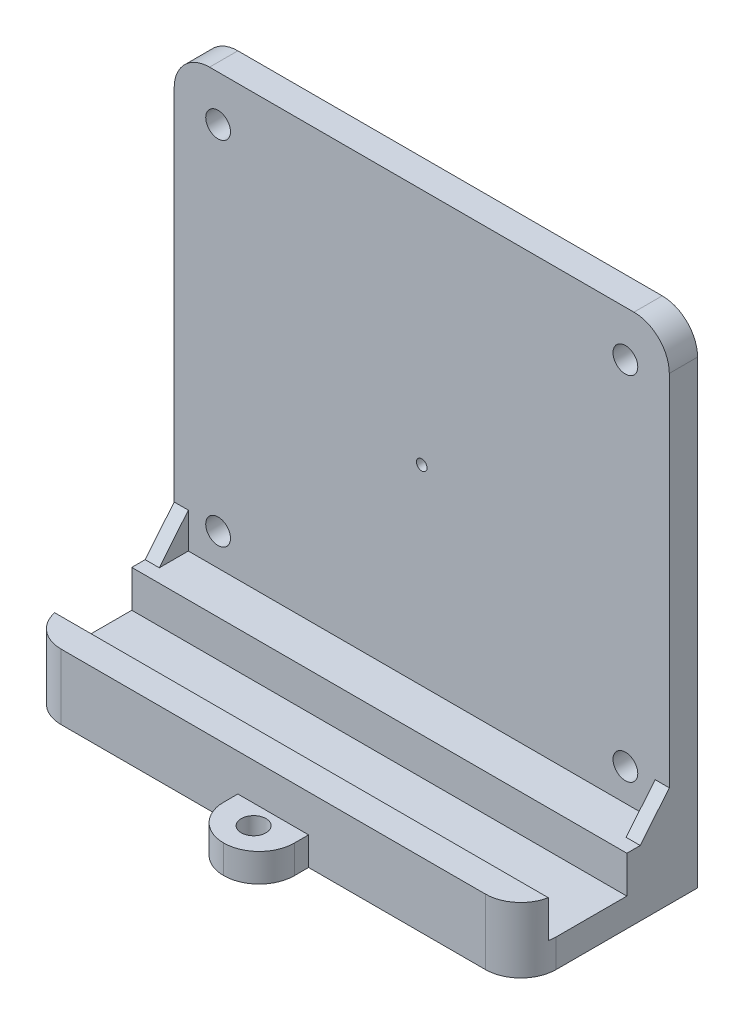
ISO-10303-21;
HEADER;
FILE_DESCRIPTION(('STEP AP214'),'2;1');
FILE_NAME('part.step','',(''),(''),'','','');
FILE_SCHEMA(('AUTOMOTIVE_DESIGN { 1 0 10303 214 1 1 1 1 }'));
ENDSEC;
DATA;
#1=APPLICATION_CONTEXT('core data for automotive mechanical design processes');
#2=APPLICATION_PROTOCOL_DEFINITION('international standard','automotive_design',2000,#1);
#3=PRODUCT_CONTEXT('',#1,'mechanical');
#4=PRODUCT('Part','Part','',(#3));
#5=PRODUCT_RELATED_PRODUCT_CATEGORY('part','',(#4));
#6=PRODUCT_DEFINITION_FORMATION('','',#4);
#7=PRODUCT_DEFINITION_CONTEXT('part definition',#1,'design');
#8=PRODUCT_DEFINITION('design','',#6,#7);
#9=PRODUCT_DEFINITION_SHAPE('','',#8);
#10=(LENGTH_UNIT() NAMED_UNIT(*) SI_UNIT(.MILLI.,.METRE.));
#11=(NAMED_UNIT(*) PLANE_ANGLE_UNIT() SI_UNIT($,.RADIAN.));
#12=(NAMED_UNIT(*) SI_UNIT($,.STERADIAN.) SOLID_ANGLE_UNIT());
#13=UNCERTAINTY_MEASURE_WITH_UNIT(LENGTH_MEASURE(1.E-05),#10,'distance_accuracy_value','');
#14=(GEOMETRIC_REPRESENTATION_CONTEXT(3) GLOBAL_UNCERTAINTY_ASSIGNED_CONTEXT((#13)) GLOBAL_UNIT_ASSIGNED_CONTEXT((#10,
#11,#12)) REPRESENTATION_CONTEXT('',''));
#15=CARTESIAN_POINT('',(0.,0.,0.));
#16=DIRECTION('',(0.,0.,1.));
#17=DIRECTION('',(1.,0.,0.));
#18=AXIS2_PLACEMENT_3D('',#15,#16,#17);
#19=CARTESIAN_POINT('',(-70.,3.93537414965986,-4.79591836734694));
#20=DIRECTION('',(0.,1.,0.));
#21=DIRECTION('',(0.,0.,1.));
#22=AXIS2_PLACEMENT_3D('',#19,#20,#21);
#23=PLANE('',#22);
#24=DIRECTION('',(0.,0.,-1.));
#25=VECTOR('',#24,1.);
#26=CARTESIAN_POINT('',(-68.,3.93537414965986,-6.68880737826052));
#27=LINE('',#26,#25);
#28=CARTESIAN_POINT('',(-68.,3.93537414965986,-6.68880737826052));
#29=VERTEX_POINT('',#28);
#30=CARTESIAN_POINT('',(-68.,3.93537414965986,-10.7959183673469));
#31=VERTEX_POINT('',#30);
#32=EDGE_CURVE('E280',#29,#31,#27,.T.);
#33=ORIENTED_EDGE('',*,*,#32,.F.);
#34=DIRECTION('',(-1.,0.,0.));
#35=VECTOR('',#34,1.);
#36=CARTESIAN_POINT('',(-68.,3.93537414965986,-6.68880737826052));
#37=LINE('',#36,#35);
#38=CARTESIAN_POINT('',(-70.,3.93537414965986,-6.68880737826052));
#39=VERTEX_POINT('',#38);
#40=EDGE_CURVE('E288',#29,#39,#37,.T.);
#41=ORIENTED_EDGE('',*,*,#40,.T.);
#42=DIRECTION('',(0.,0.,1.));
#43=VECTOR('',#42,1.);
#44=CARTESIAN_POINT('',(-70.,3.93537414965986,-4.79591836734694));
#45=LINE('',#44,#43);
#46=CARTESIAN_POINT('',(-70.,3.93537414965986,-4.79591836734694));
#47=VERTEX_POINT('',#46);
#48=EDGE_CURVE('E333',#39,#47,#45,.T.);
#49=ORIENTED_EDGE('',*,*,#48,.T.);
#50=DIRECTION('',(1.,0.,0.));
#51=VECTOR('',#50,1.);
#52=CARTESIAN_POINT('',(-70.,3.93537414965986,-4.79591836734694));
#53=LINE('',#52,#51);
#54=CARTESIAN_POINT('',(0.,3.93537414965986,-4.79591836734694));
#55=VERTEX_POINT('',#54);
#56=EDGE_CURVE('E379',#47,#55,#53,.T.);
#57=ORIENTED_EDGE('',*,*,#56,.T.);
#58=DIRECTION('',(0.,0.,1.));
#59=VECTOR('',#58,1.);
#60=CARTESIAN_POINT('',(0.,3.93537414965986,-4.79591836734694));
#61=LINE('',#60,#59);
#62=CARTESIAN_POINT('',(0.,3.93537414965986,-6.68880737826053));
#63=VERTEX_POINT('',#62);
#64=EDGE_CURVE('E355',#63,#55,#61,.T.);
#65=ORIENTED_EDGE('',*,*,#64,.F.);
#66=DIRECTION('',(1.,0.,0.));
#67=VECTOR('',#66,1.);
#68=CARTESIAN_POINT('',(-2.,3.93537414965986,-6.68880737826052));
#69=LINE('',#68,#67);
#70=CARTESIAN_POINT('',(-2.,3.93537414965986,-6.68880737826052));
#71=VERTEX_POINT('',#70);
#72=EDGE_CURVE('E314',#71,#63,#69,.T.);
#73=ORIENTED_EDGE('',*,*,#72,.F.);
#74=DIRECTION('',(0.,0.,-1.));
#75=VECTOR('',#74,1.);
#76=CARTESIAN_POINT('',(-2.,3.93537414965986,-6.68880737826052));
#77=LINE('',#76,#75);
#78=CARTESIAN_POINT('',(-2.,3.93537414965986,-10.7959183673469));
#79=VERTEX_POINT('',#78);
#80=EDGE_CURVE('E307',#71,#79,#77,.T.);
#81=ORIENTED_EDGE('',*,*,#80,.T.);
#82=DIRECTION('',(1.,0.,0.));
#83=VECTOR('',#82,1.);
#84=CARTESIAN_POINT('',(-70.,3.93537414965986,-10.7959183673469));
#85=LINE('',#84,#83);
#86=EDGE_CURVE('E383',#31,#79,#85,.T.);
#87=ORIENTED_EDGE('',*,*,#86,.F.);
#88=EDGE_LOOP('',(#33,#41,#49,#57,#65,#73,#81,#87));
#89=FACE_BOUND('',#88,.T.);
#90=ADVANCED_FACE('F39',(#89),#23,.T.);
#91=CARTESIAN_POINT('',(-70.,3.93537414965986,-10.7959183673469));
#92=DIRECTION('',(0.,0.,1.));
#93=DIRECTION('',(1.,0.,0.));
#94=AXIS2_PLACEMENT_3D('',#91,#92,#93);
#95=PLANE('',#94);
#96=CARTESIAN_POINT('',(-35.,30.9853741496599,-10.7959183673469));
#97=DIRECTION('',(0.,0.,1.));
#98=DIRECTION('',(1.,0.,0.));
#99=AXIS2_PLACEMENT_3D('',#96,#97,#98);
#100=CIRCLE('',#99,0.749999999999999);
#101=CARTESIAN_POINT('',(-34.25,30.9853741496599,-10.7959183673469));
#102=VERTEX_POINT('',#101);
#103=EDGE_CURVE('E487',#102,#102,#100,.T.);
#104=ORIENTED_EDGE('',*,*,#103,.F.);
#105=EDGE_LOOP('',(#104));
#106=FACE_BOUND('',#105,.T.);
#107=CARTESIAN_POINT('',(-63.7932426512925,58.2515739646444,-10.7959183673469));
#108=DIRECTION('',(0.,0.,-1.));
#109=DIRECTION('',(-1.,0.,0.));
#110=AXIS2_PLACEMENT_3D('',#107,#108,#109);
#111=CIRCLE('',#110,1.75);
#112=CARTESIAN_POINT('',(-65.5432426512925,58.2515739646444,-10.7959183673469));
#113=VERTEX_POINT('',#112);
#114=EDGE_CURVE('E249',#113,#113,#111,.T.);
#115=ORIENTED_EDGE('',*,*,#114,.T.);
#116=EDGE_LOOP('',(#115));
#117=FACE_BOUND('',#116,.T.);
#118=CARTESIAN_POINT('',(-63.7932426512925,8.46246083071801,-10.7959183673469));
#119=DIRECTION('',(0.,0.,-1.));
#120=DIRECTION('',(-1.,0.,0.));
#121=AXIS2_PLACEMENT_3D('',#118,#119,#120);
#122=CIRCLE('',#121,1.75);
#123=CARTESIAN_POINT('',(-65.5432426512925,8.46246083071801,-10.7959183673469));
#124=VERTEX_POINT('',#123);
#125=EDGE_CURVE('E243',#124,#124,#122,.T.);
#126=ORIENTED_EDGE('',*,*,#125,.T.);
#127=EDGE_LOOP('',(#126));
#128=FACE_BOUND('',#127,.T.);
#129=CARTESIAN_POINT('',(-6.20675734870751,58.2515739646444,-10.7959183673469));
#130=DIRECTION('',(0.,0.,1.));
#131=DIRECTION('',(1.,0.,0.));
#132=AXIS2_PLACEMENT_3D('',#129,#130,#131);
#133=CIRCLE('',#132,1.75);
#134=CARTESIAN_POINT('',(-4.45675734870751,58.2515739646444,-10.7959183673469));
#135=VERTEX_POINT('',#134);
#136=EDGE_CURVE('E265',#135,#135,#133,.T.);
#137=ORIENTED_EDGE('',*,*,#136,.F.);
#138=EDGE_LOOP('',(#137));
#139=FACE_BOUND('',#138,.T.);
#140=CARTESIAN_POINT('',(-6.20675734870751,8.46246083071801,-10.7959183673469));
#141=DIRECTION('',(0.,0.,1.));
#142=DIRECTION('',(1.,0.,0.));
#143=AXIS2_PLACEMENT_3D('',#140,#141,#142);
#144=CIRCLE('',#143,1.75);
#145=CARTESIAN_POINT('',(-4.45675734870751,8.46246083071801,-10.7959183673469));
#146=VERTEX_POINT('',#145);
#147=EDGE_CURVE('E248',#146,#146,#144,.T.);
#148=ORIENTED_EDGE('',*,*,#147,.F.);
#149=EDGE_LOOP('',(#148));
#150=FACE_BOUND('',#149,.T.);
#151=DIRECTION('',(0.,-1.,0.));
#152=VECTOR('',#151,1.);
#153=CARTESIAN_POINT('',(-70.,3.93537414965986,-10.7959183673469));
#154=LINE('',#153,#152);
#155=CARTESIAN_POINT('',(-70.,59.6853741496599,-10.7959183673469));
#156=VERTEX_POINT('',#155);
#157=CARTESIAN_POINT('',(-70.,8.94117604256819,-10.7959183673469));
#158=VERTEX_POINT('',#157);
#159=EDGE_CURVE('E330',#156,#158,#154,.T.);
#160=ORIENTED_EDGE('',*,*,#159,.T.);
#161=DIRECTION('',(-1.,0.,0.));
#162=VECTOR('',#161,1.);
#163=CARTESIAN_POINT('',(-68.,8.94117604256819,-10.7959183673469));
#164=LINE('',#163,#162);
#165=CARTESIAN_POINT('',(-68.,8.94117604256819,-10.7959183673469));
#166=VERTEX_POINT('',#165);
#167=EDGE_CURVE('E292',#166,#158,#164,.T.);
#168=ORIENTED_EDGE('',*,*,#167,.F.);
#169=DIRECTION('',(0.,1.,0.));
#170=VECTOR('',#169,1.);
#171=CARTESIAN_POINT('',(-68.,3.93537414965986,-10.7959183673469));
#172=LINE('',#171,#170);
#173=EDGE_CURVE('E276',#31,#166,#172,.T.);
#174=ORIENTED_EDGE('',*,*,#173,.F.);
#175=ORIENTED_EDGE('',*,*,#86,.T.);
#176=DIRECTION('',(0.,1.,0.));
#177=VECTOR('',#176,1.);
#178=CARTESIAN_POINT('',(-2.,3.93537414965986,-10.7959183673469));
#179=LINE('',#178,#177);
#180=CARTESIAN_POINT('',(-2.,8.94117604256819,-10.7959183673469));
#181=VERTEX_POINT('',#180);
#182=EDGE_CURVE('E300',#79,#181,#179,.T.);
#183=ORIENTED_EDGE('',*,*,#182,.T.);
#184=DIRECTION('',(1.,0.,0.));
#185=VECTOR('',#184,1.);
#186=CARTESIAN_POINT('',(-2.,8.94117604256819,-10.7959183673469));
#187=LINE('',#186,#185);
#188=CARTESIAN_POINT('',(0.,8.94117604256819,-10.7959183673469));
#189=VERTEX_POINT('',#188);
#190=EDGE_CURVE('E311',#181,#189,#187,.T.);
#191=ORIENTED_EDGE('',*,*,#190,.T.);
#192=DIRECTION('',(0.,-1.,0.));
#193=VECTOR('',#192,1.);
#194=CARTESIAN_POINT('',(0.,3.93537414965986,-10.7959183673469));
#195=LINE('',#194,#193);
#196=CARTESIAN_POINT('',(0.,59.6853741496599,-10.7959183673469));
#197=VERTEX_POINT('',#196);
#198=EDGE_CURVE('E351',#197,#189,#195,.T.);
#199=ORIENTED_EDGE('',*,*,#198,.F.);
#200=CARTESIAN_POINT('',(-5.,59.6853741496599,-10.7959183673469));
#201=DIRECTION('',(0.,0.,1.));
#202=DIRECTION('',(1.,0.,0.));
#203=AXIS2_PLACEMENT_3D('',#200,#201,#202);
#204=CIRCLE('',#203,5.);
#205=CARTESIAN_POINT('',(-5.,64.6853741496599,-10.7959183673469));
#206=VERTEX_POINT('',#205);
#207=EDGE_CURVE('E407',#197,#206,#204,.T.);
#208=ORIENTED_EDGE('',*,*,#207,.T.);
#209=DIRECTION('',(1.,0.,0.));
#210=VECTOR('',#209,1.);
#211=CARTESIAN_POINT('',(-70.,64.6853741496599,-10.7959183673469));
#212=LINE('',#211,#210);
#213=CARTESIAN_POINT('',(-65.,64.6853741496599,-10.7959183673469));
#214=VERTEX_POINT('',#213);
#215=EDGE_CURVE('E386',#214,#206,#212,.T.);
#216=ORIENTED_EDGE('',*,*,#215,.F.);
#217=CARTESIAN_POINT('',(-65.,59.6853741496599,-10.7959183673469));
#218=DIRECTION('',(0.,0.,1.));
#219=DIRECTION('',(1.,0.,0.));
#220=AXIS2_PLACEMENT_3D('',#217,#218,#219);
#221=CIRCLE('',#220,5.);
#222=EDGE_CURVE('E404',#214,#156,#221,.T.);
#223=ORIENTED_EDGE('',*,*,#222,.T.);
#224=EDGE_LOOP('',(#160,#168,#174,#175,#183,#191,#199,#208,#216,#223));
#225=FACE_BOUND('',#224,.T.);
#226=ADVANCED_FACE('F526',(#106,#117,#128,#139,#150,#225),#95,.T.);
#227=CARTESIAN_POINT('',(-70.,-5.31462585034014,10.2040816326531));
#228=DIRECTION('',(0.,0.,1.));
#229=DIRECTION('',(1.,0.,0.));
#230=AXIS2_PLACEMENT_3D('',#227,#228,#229);
#231=PLANE('',#230);
#232=DIRECTION('',(1.,0.,0.));
#233=VECTOR('',#232,1.);
#234=CARTESIAN_POINT('',(-70.,3.93537414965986,10.2040816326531));
#235=LINE('',#234,#233);
#236=CARTESIAN_POINT('',(-65.,3.93537414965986,10.2040816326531));
#237=VERTEX_POINT('',#236);
#238=CARTESIAN_POINT('',(-5.,3.93537414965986,10.2040816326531));
#239=VERTEX_POINT('',#238);
#240=EDGE_CURVE('E365',#237,#239,#235,.T.);
#241=ORIENTED_EDGE('',*,*,#240,.F.);
#242=DIRECTION('',(0.,-1.,0.));
#243=VECTOR('',#242,1.);
#244=CARTESIAN_POINT('',(-65.,-5.31462585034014,10.2040816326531));
#245=LINE('',#244,#243);
#246=CARTESIAN_POINT('',(-65.,-5.31462585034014,10.2040816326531));
#247=VERTEX_POINT('',#246);
#248=EDGE_CURVE('E452',#237,#247,#245,.T.);
#249=ORIENTED_EDGE('',*,*,#248,.T.);
#250=DIRECTION('',(1.,0.,0.));
#251=VECTOR('',#250,1.);
#252=CARTESIAN_POINT('',(-70.,-5.31462585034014,10.2040816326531));
#253=LINE('',#252,#251);
#254=CARTESIAN_POINT('',(-40.,-5.31462585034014,10.2040816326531));
#255=VERTEX_POINT('',#254);
#256=EDGE_CURVE('E398',#247,#255,#253,.T.);
#257=ORIENTED_EDGE('',*,*,#256,.T.);
#258=DIRECTION('',(0.,-1.,0.));
#259=VECTOR('',#258,1.);
#260=CARTESIAN_POINT('',(-40.,-5.31462585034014,10.2040816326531));
#261=LINE('',#260,#259);
#262=CARTESIAN_POINT('',(-40.,-1.31462585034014,10.2040816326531));
#263=VERTEX_POINT('',#262);
#264=EDGE_CURVE('E223',#263,#255,#261,.T.);
#265=ORIENTED_EDGE('',*,*,#264,.F.);
#266=DIRECTION('',(-1.,0.,0.));
#267=VECTOR('',#266,1.);
#268=CARTESIAN_POINT('',(-40.,-1.31462585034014,10.2040816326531));
#269=LINE('',#268,#267);
#270=CARTESIAN_POINT('',(-30.,-1.31462585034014,10.2040816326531));
#271=VERTEX_POINT('',#270);
#272=EDGE_CURVE('E203',#271,#263,#269,.T.);
#273=ORIENTED_EDGE('',*,*,#272,.F.);
#274=DIRECTION('',(0.,1.,0.));
#275=VECTOR('',#274,1.);
#276=CARTESIAN_POINT('',(-30.,-5.31462585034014,10.2040816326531));
#277=LINE('',#276,#275);
#278=CARTESIAN_POINT('',(-30.,-5.31462585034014,10.2040816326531));
#279=VERTEX_POINT('',#278);
#280=EDGE_CURVE('E220',#279,#271,#277,.T.);
#281=ORIENTED_EDGE('',*,*,#280,.F.);
#282=CARTESIAN_POINT('',(-5.,-5.31462585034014,10.2040816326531));
#283=VERTEX_POINT('',#282);
#284=EDGE_CURVE('E344',#279,#283,#253,.T.);
#285=ORIENTED_EDGE('',*,*,#284,.T.);
#286=DIRECTION('',(0.,-1.,0.));
#287=VECTOR('',#286,1.);
#288=CARTESIAN_POINT('',(-5.,3.93537414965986,10.2040816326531));
#289=LINE('',#288,#287);
#290=EDGE_CURVE('E449',#283,#239,#289,.F.);
#291=ORIENTED_EDGE('',*,*,#290,.T.);
#292=EDGE_LOOP('',(#241,#249,#257,#265,#273,#281,#285,#291));
#293=FACE_BOUND('',#292,.T.);
#294=ADVANCED_FACE('F218',(#293),#231,.T.);
#295=CARTESIAN_POINT('',(-70.,3.93537414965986,10.2040816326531));
#296=DIRECTION('',(0.,1.,0.));
#297=DIRECTION('',(0.,0.,1.));
#298=AXIS2_PLACEMENT_3D('',#295,#296,#297);
#299=PLANE('',#298);
#300=DIRECTION('',(1.,0.,0.));
#301=VECTOR('',#300,1.);
#302=CARTESIAN_POINT('',(-70.,3.93537414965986,6.20408163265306));
#303=LINE('',#302,#301);
#304=CARTESIAN_POINT('',(-69.8989794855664,3.93537414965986,6.20408163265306));
#305=VERTEX_POINT('',#304);
#306=CARTESIAN_POINT('',(-0.101020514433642,3.93537414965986,6.20408163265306));
#307=VERTEX_POINT('',#306);
#308=EDGE_CURVE('E369',#305,#307,#303,.T.);
#309=ORIENTED_EDGE('',*,*,#308,.F.);
#310=CARTESIAN_POINT('',(-65.,3.93537414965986,5.20408163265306));
#311=DIRECTION('',(0.,1.,0.));
#312=DIRECTION('',(0.,0.,1.));
#313=AXIS2_PLACEMENT_3D('',#310,#311,#312);
#314=CIRCLE('',#313,5.);
#315=EDGE_CURVE('E49',#305,#237,#314,.T.);
#316=ORIENTED_EDGE('',*,*,#315,.T.);
#317=ORIENTED_EDGE('',*,*,#240,.T.);
#318=CARTESIAN_POINT('',(-5.,3.93537414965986,5.20408163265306));
#319=DIRECTION('',(0.,1.,0.));
#320=DIRECTION('',(0.,0.,1.));
#321=AXIS2_PLACEMENT_3D('',#318,#319,#320);
#322=CIRCLE('',#321,5.);
#323=EDGE_CURVE('E57',#239,#307,#322,.T.);
#324=ORIENTED_EDGE('',*,*,#323,.T.);
#325=EDGE_LOOP('',(#309,#316,#317,#324));
#326=FACE_BOUND('',#325,.T.);
#327=ADVANCED_FACE('F600',(#326),#299,.T.);
#328=CARTESIAN_POINT('',(-70.,3.93537414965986,6.20408163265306));
#329=DIRECTION('',(0.,0.,-1.));
#330=DIRECTION('',(0.,1.,0.));
#331=AXIS2_PLACEMENT_3D('',#328,#329,#330);
#332=PLANE('',#331);
#333=DIRECTION('',(1.,0.,0.));
#334=VECTOR('',#333,1.);
#335=CARTESIAN_POINT('',(-70.,-1.31462585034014,6.20408163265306));
#336=LINE('',#335,#334);
#337=CARTESIAN_POINT('',(-69.8989794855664,-1.31462585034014,6.20408163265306));
#338=VERTEX_POINT('',#337);
#339=CARTESIAN_POINT('',(-0.101020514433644,-1.31462585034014,6.20408163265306));
#340=VERTEX_POINT('',#339);
#341=EDGE_CURVE('E372',#338,#340,#336,.T.);
#342=ORIENTED_EDGE('',*,*,#341,.F.);
#343=DIRECTION('',(0.,-1.,0.));
#344=VECTOR('',#343,1.);
#345=CARTESIAN_POINT('',(-69.8989794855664,-1.31462585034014,6.20408163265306));
#346=LINE('',#345,#344);
#347=EDGE_CURVE('E64',#338,#305,#346,.F.);
#348=ORIENTED_EDGE('',*,*,#347,.T.);
#349=ORIENTED_EDGE('',*,*,#308,.T.);
#350=DIRECTION('',(0.,1.,0.));
#351=VECTOR('',#350,1.);
#352=CARTESIAN_POINT('',(-0.101020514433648,3.93537414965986,6.20408163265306));
#353=LINE('',#352,#351);
#354=EDGE_CURVE('E465',#307,#340,#353,.F.);
#355=ORIENTED_EDGE('',*,*,#354,.T.);
#356=EDGE_LOOP('',(#342,#348,#349,#355));
#357=FACE_BOUND('',#356,.T.);
#358=ADVANCED_FACE('F620',(#357),#332,.T.);
#359=CARTESIAN_POINT('',(-70.,-1.31462585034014,6.20408163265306));
#360=DIRECTION('',(0.,1.,0.));
#361=DIRECTION('',(0.,0.,1.));
#362=AXIS2_PLACEMENT_3D('',#359,#360,#361);
#363=PLANE('',#362);
#364=DIRECTION('',(0.,0.,1.));
#365=VECTOR('',#364,1.);
#366=CARTESIAN_POINT('',(-70.,-1.31462585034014,6.20408163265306));
#367=LINE('',#366,#365);
#368=CARTESIAN_POINT('',(-70.,-1.31462585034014,-4.79591836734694));
#369=VERTEX_POINT('',#368);
#370=CARTESIAN_POINT('',(-70.,-1.31462585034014,5.20408163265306));
#371=VERTEX_POINT('',#370);
#372=EDGE_CURVE('E340',#369,#371,#367,.T.);
#373=ORIENTED_EDGE('',*,*,#372,.T.);
#374=CARTESIAN_POINT('',(-65.,-1.31462585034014,5.20408163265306));
#375=DIRECTION('',(0.,1.,0.));
#376=DIRECTION('',(0.,0.,1.));
#377=AXIS2_PLACEMENT_3D('',#374,#375,#376);
#378=CIRCLE('',#377,5.);
#379=EDGE_CURVE('E462',#371,#338,#378,.T.);
#380=ORIENTED_EDGE('',*,*,#379,.T.);
#381=ORIENTED_EDGE('',*,*,#341,.T.);
#382=CARTESIAN_POINT('',(-5.,-1.31462585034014,5.20408163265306));
#383=DIRECTION('',(0.,1.,0.));
#384=DIRECTION('',(0.,0.,1.));
#385=AXIS2_PLACEMENT_3D('',#382,#383,#384);
#386=CIRCLE('',#385,5.);
#387=CARTESIAN_POINT('',(0.,-1.31462585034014,5.20408163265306));
#388=VERTEX_POINT('',#387);
#389=EDGE_CURVE('E459',#340,#388,#386,.T.);
#390=ORIENTED_EDGE('',*,*,#389,.T.);
#391=DIRECTION('',(0.,0.,1.));
#392=VECTOR('',#391,1.);
#393=CARTESIAN_POINT('',(0.,-1.31462585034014,6.20408163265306));
#394=LINE('',#393,#392);
#395=CARTESIAN_POINT('',(0.,-1.31462585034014,-4.79591836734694));
#396=VERTEX_POINT('',#395);
#397=EDGE_CURVE('E326',#396,#388,#394,.T.);
#398=ORIENTED_EDGE('',*,*,#397,.F.);
#399=DIRECTION('',(1.,0.,0.));
#400=VECTOR('',#399,1.);
#401=CARTESIAN_POINT('',(-70.,-1.31462585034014,-4.79591836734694));
#402=LINE('',#401,#400);
#403=EDGE_CURVE('E376',#369,#396,#402,.T.);
#404=ORIENTED_EDGE('',*,*,#403,.F.);
#405=EDGE_LOOP('',(#373,#380,#381,#390,#398,#404));
#406=FACE_BOUND('',#405,.T.);
#407=ADVANCED_FACE('F548',(#406),#363,.T.);
#408=CARTESIAN_POINT('',(-70.,-1.31462585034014,-4.79591836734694));
#409=DIRECTION('',(0.,0.,1.));
#410=DIRECTION('',(1.,0.,0.));
#411=AXIS2_PLACEMENT_3D('',#408,#409,#410);
#412=PLANE('',#411);
#413=DIRECTION('',(0.,-1.,0.));
#414=VECTOR('',#413,1.);
#415=CARTESIAN_POINT('',(0.,-1.31462585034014,-4.79591836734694));
#416=LINE('',#415,#414);
#417=EDGE_CURVE('E358',#55,#396,#416,.T.);
#418=ORIENTED_EDGE('',*,*,#417,.F.);
#419=ORIENTED_EDGE('',*,*,#56,.F.);
#420=DIRECTION('',(0.,-1.,0.));
#421=VECTOR('',#420,1.);
#422=CARTESIAN_POINT('',(-70.,-1.31462585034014,-4.79591836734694));
#423=LINE('',#422,#421);
#424=EDGE_CURVE('E336',#47,#369,#423,.T.);
#425=ORIENTED_EDGE('',*,*,#424,.T.);
#426=ORIENTED_EDGE('',*,*,#403,.T.);
#427=EDGE_LOOP('',(#418,#419,#425,#426));
#428=FACE_BOUND('',#427,.T.);
#429=ADVANCED_FACE('F544',(#428),#412,.T.);
#430=CARTESIAN_POINT('',(-70.,64.6853741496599,-10.7959183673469));
#431=DIRECTION('',(0.,1.,0.));
#432=DIRECTION('',(0.,0.,1.));
#433=AXIS2_PLACEMENT_3D('',#430,#431,#432);
#434=PLANE('',#433);
#435=ORIENTED_EDGE('',*,*,#215,.T.);
#436=DIRECTION('',(0.,0.,1.));
#437=VECTOR('',#436,1.);
#438=CARTESIAN_POINT('',(-5.,64.6853741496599,-14.7959183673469));
#439=LINE('',#438,#437);
#440=CARTESIAN_POINT('',(-5.,64.6853741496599,-14.7959183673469));
#441=VERTEX_POINT('',#440);
#442=EDGE_CURVE('E414',#206,#441,#439,.F.);
#443=ORIENTED_EDGE('',*,*,#442,.T.);
#444=DIRECTION('',(1.,0.,0.));
#445=VECTOR('',#444,1.);
#446=CARTESIAN_POINT('',(-70.,64.6853741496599,-14.7959183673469));
#447=LINE('',#446,#445);
#448=CARTESIAN_POINT('',(-65.,64.6853741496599,-14.7959183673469));
#449=VERTEX_POINT('',#448);
#450=EDGE_CURVE('E390',#449,#441,#447,.T.);
#451=ORIENTED_EDGE('',*,*,#450,.F.);
#452=DIRECTION('',(0.,0.,1.));
#453=VECTOR('',#452,1.);
#454=CARTESIAN_POINT('',(-65.,64.6853741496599,-10.7959183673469));
#455=LINE('',#454,#453);
#456=EDGE_CURVE('E410',#449,#214,#455,.T.);
#457=ORIENTED_EDGE('',*,*,#456,.T.);
#458=EDGE_LOOP('',(#435,#443,#451,#457));
#459=FACE_BOUND('',#458,.T.);
#460=ADVANCED_FACE('F502',(#459),#434,.T.);
#461=CARTESIAN_POINT('',(-70.,64.6853741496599,-14.7959183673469));
#462=DIRECTION('',(0.,0.,-1.));
#463=DIRECTION('',(0.,1.,0.));
#464=AXIS2_PLACEMENT_3D('',#461,#462,#463);
#465=PLANE('',#464);
#466=CARTESIAN_POINT('',(-35.,30.9853741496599,-14.7959183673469));
#467=DIRECTION('',(0.,0.,-1.));
#468=DIRECTION('',(0.,1.,0.));
#469=AXIS2_PLACEMENT_3D('',#466,#467,#468);
#470=CIRCLE('',#469,0.749999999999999);
#471=CARTESIAN_POINT('',(-35.,31.7353741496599,-14.7959183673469));
#472=VERTEX_POINT('',#471);
#473=EDGE_CURVE('E43',#472,#472,#470,.T.);
#474=ORIENTED_EDGE('',*,*,#473,.F.);
#475=EDGE_LOOP('',(#474));
#476=FACE_BOUND('',#475,.T.);
#477=CARTESIAN_POINT('',(-63.7932426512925,58.2515739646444,-14.7959183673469));
#478=DIRECTION('',(0.,0.,-1.));
#479=DIRECTION('',(-1.,0.,0.));
#480=AXIS2_PLACEMENT_3D('',#477,#478,#479);
#481=CIRCLE('',#480,1.75);
#482=CARTESIAN_POINT('',(-65.5432426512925,58.2515739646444,-14.7959183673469));
#483=VERTEX_POINT('',#482);
#484=EDGE_CURVE('E244',#483,#483,#481,.T.);
#485=ORIENTED_EDGE('',*,*,#484,.F.);
#486=EDGE_LOOP('',(#485));
#487=FACE_BOUND('',#486,.T.);
#488=CARTESIAN_POINT('',(-63.7932426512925,8.46246083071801,-14.7959183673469));
#489=DIRECTION('',(0.,0.,-1.));
#490=DIRECTION('',(-1.,0.,0.));
#491=AXIS2_PLACEMENT_3D('',#488,#489,#490);
#492=CIRCLE('',#491,1.75);
#493=CARTESIAN_POINT('',(-65.5432426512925,8.46246083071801,-14.7959183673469));
#494=VERTEX_POINT('',#493);
#495=EDGE_CURVE('E253',#494,#494,#492,.T.);
#496=ORIENTED_EDGE('',*,*,#495,.F.);
#497=EDGE_LOOP('',(#496));
#498=FACE_BOUND('',#497,.T.);
#499=CARTESIAN_POINT('',(-6.20675734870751,58.2515739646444,-14.7959183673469));
#500=DIRECTION('',(0.,0.,1.));
#501=DIRECTION('',(1.,0.,0.));
#502=AXIS2_PLACEMENT_3D('',#499,#500,#501);
#503=CIRCLE('',#502,1.75);
#504=CARTESIAN_POINT('',(-4.45675734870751,58.2515739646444,-14.7959183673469));
#505=VERTEX_POINT('',#504);
#506=EDGE_CURVE('E260',#505,#505,#503,.T.);
#507=ORIENTED_EDGE('',*,*,#506,.T.);
#508=EDGE_LOOP('',(#507));
#509=FACE_BOUND('',#508,.T.);
#510=CARTESIAN_POINT('',(-6.20675734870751,8.46246083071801,-14.7959183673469));
#511=DIRECTION('',(0.,0.,1.));
#512=DIRECTION('',(1.,0.,0.));
#513=AXIS2_PLACEMENT_3D('',#510,#511,#512);
#514=CIRCLE('',#513,1.75);
#515=CARTESIAN_POINT('',(-4.45675734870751,8.46246083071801,-14.7959183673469));
#516=VERTEX_POINT('',#515);
#517=EDGE_CURVE('E269',#516,#516,#514,.T.);
#518=ORIENTED_EDGE('',*,*,#517,.T.);
#519=EDGE_LOOP('',(#518));
#520=FACE_BOUND('',#519,.T.);
#521=ORIENTED_EDGE('',*,*,#450,.T.);
#522=CARTESIAN_POINT('',(-5.,59.6853741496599,-14.7959183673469));
#523=DIRECTION('',(0.,0.,-1.));
#524=DIRECTION('',(0.,1.,0.));
#525=AXIS2_PLACEMENT_3D('',#522,#523,#524);
#526=CIRCLE('',#525,5.);
#527=CARTESIAN_POINT('',(0.,59.6853741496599,-14.7959183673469));
#528=VERTEX_POINT('',#527);
#529=EDGE_CURVE('E420',#441,#528,#526,.T.);
#530=ORIENTED_EDGE('',*,*,#529,.T.);
#531=DIRECTION('',(0.,1.,0.));
#532=VECTOR('',#531,1.);
#533=CARTESIAN_POINT('',(0.,64.6853741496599,-14.7959183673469));
#534=LINE('',#533,#532);
#535=CARTESIAN_POINT('',(0.,-5.31462585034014,-14.7959183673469));
#536=VERTEX_POINT('',#535);
#537=EDGE_CURVE('E347',#536,#528,#534,.T.);
#538=ORIENTED_EDGE('',*,*,#537,.F.);
#539=DIRECTION('',(1.,0.,0.));
#540=VECTOR('',#539,1.);
#541=CARTESIAN_POINT('',(-70.,-5.31462585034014,-14.7959183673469));
#542=LINE('',#541,#540);
#543=CARTESIAN_POINT('',(-70.,-5.31462585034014,-14.7959183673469));
#544=VERTEX_POINT('',#543);
#545=EDGE_CURVE('E394',#544,#536,#542,.T.);
#546=ORIENTED_EDGE('',*,*,#545,.F.);
#547=DIRECTION('',(0.,1.,0.));
#548=VECTOR('',#547,1.);
#549=CARTESIAN_POINT('',(-70.,64.6853741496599,-14.7959183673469));
#550=LINE('',#549,#548);
#551=CARTESIAN_POINT('',(-70.,59.6853741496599,-14.7959183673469));
#552=VERTEX_POINT('',#551);
#553=EDGE_CURVE('E325',#544,#552,#550,.T.);
#554=ORIENTED_EDGE('',*,*,#553,.T.);
#555=CARTESIAN_POINT('',(-65.,59.6853741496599,-14.7959183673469));
#556=DIRECTION('',(0.,0.,-1.));
#557=DIRECTION('',(0.,1.,0.));
#558=AXIS2_PLACEMENT_3D('',#555,#556,#557);
#559=CIRCLE('',#558,5.);
#560=EDGE_CURVE('E417',#552,#449,#559,.T.);
#561=ORIENTED_EDGE('',*,*,#560,.T.);
#562=EDGE_LOOP('',(#521,#530,#538,#546,#554,#561));
#563=FACE_BOUND('',#562,.T.);
#564=ADVANCED_FACE('F498',(#476,#487,#498,#509,#520,#563),#465,.T.);
#565=CARTESIAN_POINT('',(-70.,-5.31462585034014,10.2040816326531));
#566=DIRECTION('',(0.,-1.,0.));
#567=DIRECTION('',(0.,0.,-1.));
#568=AXIS2_PLACEMENT_3D('',#565,#566,#567);
#569=PLANE('',#568);
#570=CARTESIAN_POINT('',(-35.0035421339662,-5.31462585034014,12.971264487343));
#571=DIRECTION('',(0.,-1.,0.));
#572=DIRECTION('',(0.,0.,-1.));
#573=AXIS2_PLACEMENT_3D('',#570,#571,#572);
#574=CIRCLE('',#573,1.75);
#575=CARTESIAN_POINT('',(-35.0035421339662,-5.31462585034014,11.221264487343));
#576=VERTEX_POINT('',#575);
#577=EDGE_CURVE('E475',#576,#576,#574,.T.);
#578=ORIENTED_EDGE('',*,*,#577,.F.);
#579=EDGE_LOOP('',(#578));
#580=FACE_BOUND('',#579,.T.);
#581=DIRECTION('',(0.,0.,-1.));
#582=VECTOR('',#581,1.);
#583=CARTESIAN_POINT('',(-30.,-5.31462585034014,17.2040816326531));
#584=LINE('',#583,#582);
#585=CARTESIAN_POINT('',(-30.,-5.31462585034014,12.2040816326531));
#586=VERTEX_POINT('',#585);
#587=EDGE_CURVE('E211',#586,#279,#584,.T.);
#588=ORIENTED_EDGE('',*,*,#587,.F.);
#589=CARTESIAN_POINT('',(-35.,-5.31462585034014,12.2040816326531));
#590=DIRECTION('',(0.,-1.,0.));
#591=DIRECTION('',(0.,0.,-1.));
#592=AXIS2_PLACEMENT_3D('',#589,#590,#591);
#593=CIRCLE('',#592,5.);
#594=CARTESIAN_POINT('',(-35.,-5.31462585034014,17.2040816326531));
#595=VERTEX_POINT('',#594);
#596=EDGE_CURVE('E443',#586,#595,#593,.T.);
#597=ORIENTED_EDGE('',*,*,#596,.T.);
#598=CARTESIAN_POINT('',(-35.,-5.31462585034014,12.2040816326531));
#599=DIRECTION('',(0.,-1.,0.));
#600=DIRECTION('',(0.,0.,-1.));
#601=AXIS2_PLACEMENT_3D('',#598,#599,#600);
#602=CIRCLE('',#601,5.);
#603=CARTESIAN_POINT('',(-40.,-5.31462585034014,12.2040816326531));
#604=VERTEX_POINT('',#603);
#605=EDGE_CURVE('E440',#595,#604,#602,.T.);
#606=ORIENTED_EDGE('',*,*,#605,.T.);
#607=DIRECTION('',(0.,0.,-1.));
#608=VECTOR('',#607,1.);
#609=CARTESIAN_POINT('',(-40.,-5.31462585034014,17.2040816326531));
#610=LINE('',#609,#608);
#611=EDGE_CURVE('E239',#604,#255,#610,.T.);
#612=ORIENTED_EDGE('',*,*,#611,.T.);
#613=ORIENTED_EDGE('',*,*,#256,.F.);
#614=CARTESIAN_POINT('',(-65.,-5.31462585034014,5.20408163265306));
#615=DIRECTION('',(0.,-1.,0.));
#616=DIRECTION('',(0.,0.,-1.));
#617=AXIS2_PLACEMENT_3D('',#614,#615,#616);
#618=CIRCLE('',#617,5.);
#619=CARTESIAN_POINT('',(-70.,-5.31462585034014,5.20408163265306));
#620=VERTEX_POINT('',#619);
#621=EDGE_CURVE('E437',#247,#620,#618,.T.);
#622=ORIENTED_EDGE('',*,*,#621,.T.);
#623=DIRECTION('',(0.,0.,-1.));
#624=VECTOR('',#623,1.);
#625=CARTESIAN_POINT('',(-70.,-5.31462585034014,10.2040816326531));
#626=LINE('',#625,#624);
#627=EDGE_CURVE('E322',#620,#544,#626,.T.);
#628=ORIENTED_EDGE('',*,*,#627,.T.);
#629=ORIENTED_EDGE('',*,*,#545,.T.);
#630=DIRECTION('',(0.,0.,-1.));
#631=VECTOR('',#630,1.);
#632=CARTESIAN_POINT('',(0.,-5.31462585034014,10.2040816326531));
#633=LINE('',#632,#631);
#634=CARTESIAN_POINT('',(0.,-5.31462585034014,5.20408163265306));
#635=VERTEX_POINT('',#634);
#636=EDGE_CURVE('E318',#635,#536,#633,.T.);
#637=ORIENTED_EDGE('',*,*,#636,.F.);
#638=CARTESIAN_POINT('',(-5.,-5.31462585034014,5.20408163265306));
#639=DIRECTION('',(0.,-1.,0.));
#640=DIRECTION('',(0.,0.,-1.));
#641=AXIS2_PLACEMENT_3D('',#638,#639,#640);
#642=CIRCLE('',#641,5.);
#643=EDGE_CURVE('E434',#635,#283,#642,.T.);
#644=ORIENTED_EDGE('',*,*,#643,.T.);
#645=ORIENTED_EDGE('',*,*,#284,.F.);
#646=EDGE_LOOP('',(#588,#597,#606,#612,#613,#622,#628,#629,#637,#644,#645));
#647=FACE_BOUND('',#646,.T.);
#648=ADVANCED_FACE('F501',(#580,#647),#569,.T.);
#649=CARTESIAN_POINT('',(-70.,0.,0.));
#650=DIRECTION('',(-1.,0.,0.));
#651=DIRECTION('',(0.,0.,1.));
#652=AXIS2_PLACEMENT_3D('',#649,#650,#651);
#653=PLANE('',#652);
#654=ORIENTED_EDGE('',*,*,#627,.F.);
#655=DIRECTION('',(0.,-1.,0.));
#656=VECTOR('',#655,1.);
#657=CARTESIAN_POINT('',(-70.,0.,5.20408163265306));
#658=LINE('',#657,#656);
#659=EDGE_CURVE('E456',#620,#371,#658,.F.);
#660=ORIENTED_EDGE('',*,*,#659,.T.);
#661=ORIENTED_EDGE('',*,*,#372,.F.);
#662=ORIENTED_EDGE('',*,*,#424,.F.);
#663=ORIENTED_EDGE('',*,*,#48,.F.);
#664=DIRECTION('',(0.,-0.773089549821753,0.634296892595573));
#665=VECTOR('',#664,1.);
#666=CARTESIAN_POINT('',(-70.,8.94117604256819,-10.7959183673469));
#667=LINE('',#666,#665);
#668=EDGE_CURVE('E264',#158,#39,#667,.T.);
#669=ORIENTED_EDGE('',*,*,#668,.F.);
#670=ORIENTED_EDGE('',*,*,#159,.F.);
#671=DIRECTION('',(0.,0.,1.));
#672=VECTOR('',#671,1.);
#673=CARTESIAN_POINT('',(-70.,59.6853741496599,0.));
#674=LINE('',#673,#672);
#675=EDGE_CURVE('E423',#156,#552,#674,.F.);
#676=ORIENTED_EDGE('',*,*,#675,.T.);
#677=ORIENTED_EDGE('',*,*,#553,.F.);
#678=EDGE_LOOP('',(#654,#660,#661,#662,#663,#669,#670,#676,#677));
#679=FACE_BOUND('',#678,.T.);
#680=ADVANCED_FACE('F559',(#679),#653,.T.);
#681=CARTESIAN_POINT('',(0.,0.,0.));
#682=DIRECTION('',(-1.,0.,0.));
#683=DIRECTION('',(0.,0.,1.));
#684=AXIS2_PLACEMENT_3D('',#681,#682,#683);
#685=PLANE('',#684);
#686=ORIENTED_EDGE('',*,*,#397,.T.);
#687=DIRECTION('',(0.,-1.,0.));
#688=VECTOR('',#687,1.);
#689=CARTESIAN_POINT('',(0.,-5.31462585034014,5.20408163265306));
#690=LINE('',#689,#688);
#691=EDGE_CURVE('E11',#388,#635,#690,.T.);
#692=ORIENTED_EDGE('',*,*,#691,.T.);
#693=ORIENTED_EDGE('',*,*,#636,.T.);
#694=ORIENTED_EDGE('',*,*,#537,.T.);
#695=DIRECTION('',(0.,0.,1.));
#696=VECTOR('',#695,1.);
#697=CARTESIAN_POINT('',(0.,59.6853741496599,-10.7959183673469));
#698=LINE('',#697,#696);
#699=EDGE_CURVE('E368',#528,#197,#698,.T.);
#700=ORIENTED_EDGE('',*,*,#699,.T.);
#701=ORIENTED_EDGE('',*,*,#198,.T.);
#702=DIRECTION('',(0.,-0.773089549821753,0.634296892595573));
#703=VECTOR('',#702,1.);
#704=CARTESIAN_POINT('',(0.,8.94117604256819,-10.7959183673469));
#705=LINE('',#704,#703);
#706=EDGE_CURVE('E296',#189,#63,#705,.T.);
#707=ORIENTED_EDGE('',*,*,#706,.T.);
#708=ORIENTED_EDGE('',*,*,#64,.T.);
#709=ORIENTED_EDGE('',*,*,#417,.T.);
#710=EDGE_LOOP('',(#686,#692,#693,#694,#700,#701,#707,#708,#709));
#711=FACE_BOUND('',#710,.T.);
#712=ADVANCED_FACE('F524',(#711),#685,.F.);
#713=CARTESIAN_POINT('',(-5.,59.6853741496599,0.));
#714=DIRECTION('',(0.,0.,-1.));
#715=DIRECTION('',(-1.,0.,0.));
#716=AXIS2_PLACEMENT_3D('',#713,#714,#715);
#717=CYLINDRICAL_SURFACE('',#716,5.);
#718=ORIENTED_EDGE('',*,*,#529,.F.);
#719=ORIENTED_EDGE('',*,*,#442,.F.);
#720=ORIENTED_EDGE('',*,*,#207,.F.);
#721=ORIENTED_EDGE('',*,*,#699,.F.);
#722=EDGE_LOOP('',(#718,#719,#720,#721));
#723=FACE_BOUND('',#722,.T.);
#724=ADVANCED_FACE('F521',(#723),#717,.T.);
#725=CARTESIAN_POINT('',(-65.,59.6853741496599,-10.7959183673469));
#726=DIRECTION('',(0.,0.,1.));
#727=DIRECTION('',(1.,0.,0.));
#728=AXIS2_PLACEMENT_3D('',#725,#726,#727);
#729=CYLINDRICAL_SURFACE('',#728,5.);
#730=ORIENTED_EDGE('',*,*,#560,.F.);
#731=ORIENTED_EDGE('',*,*,#675,.F.);
#732=ORIENTED_EDGE('',*,*,#222,.F.);
#733=ORIENTED_EDGE('',*,*,#456,.F.);
#734=EDGE_LOOP('',(#730,#731,#732,#733));
#735=FACE_BOUND('',#734,.T.);
#736=ADVANCED_FACE('F565',(#735),#729,.T.);
#737=CARTESIAN_POINT('',(-2.,8.94117604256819,-10.7959183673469));
#738=DIRECTION('',(0.,0.634296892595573,0.773089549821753));
#739=DIRECTION('',(0.,-0.773089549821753,0.634296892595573));
#740=AXIS2_PLACEMENT_3D('',#737,#738,#739);
#741=PLANE('',#740);
#742=ORIENTED_EDGE('',*,*,#706,.F.);
#743=ORIENTED_EDGE('',*,*,#190,.F.);
#744=DIRECTION('',(0.,-0.773089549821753,0.634296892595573));
#745=VECTOR('',#744,1.);
#746=CARTESIAN_POINT('',(-2.,8.94117604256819,-10.7959183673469));
#747=LINE('',#746,#745);
#748=EDGE_CURVE('E304',#181,#71,#747,.T.);
#749=ORIENTED_EDGE('',*,*,#748,.T.);
#750=ORIENTED_EDGE('',*,*,#72,.T.);
#751=EDGE_LOOP('',(#742,#743,#749,#750));
#752=FACE_BOUND('',#751,.T.);
#753=ADVANCED_FACE('F531',(#752),#741,.T.);
#754=CARTESIAN_POINT('',(-2.,0.,0.));
#755=DIRECTION('',(-1.,0.,0.));
#756=DIRECTION('',(0.,0.,1.));
#757=AXIS2_PLACEMENT_3D('',#754,#755,#756);
#758=PLANE('',#757);
#759=ORIENTED_EDGE('',*,*,#182,.F.);
#760=ORIENTED_EDGE('',*,*,#80,.F.);
#761=ORIENTED_EDGE('',*,*,#748,.F.);
#762=EDGE_LOOP('',(#759,#760,#761));
#763=FACE_BOUND('',#762,.T.);
#764=ADVANCED_FACE('F534',(#763),#758,.T.);
#765=CARTESIAN_POINT('',(-68.,8.94117604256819,-10.7959183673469));
#766=DIRECTION('',(0.,-0.634296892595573,-0.773089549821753));
#767=DIRECTION('',(0.,0.773089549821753,-0.634296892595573));
#768=AXIS2_PLACEMENT_3D('',#765,#766,#767);
#769=PLANE('',#768);
#770=ORIENTED_EDGE('',*,*,#668,.T.);
#771=ORIENTED_EDGE('',*,*,#40,.F.);
#772=DIRECTION('',(0.,-0.773089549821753,0.634296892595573));
#773=VECTOR('',#772,1.);
#774=CARTESIAN_POINT('',(-68.,8.94117604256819,-10.7959183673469));
#775=LINE('',#774,#773);
#776=EDGE_CURVE('E284',#166,#29,#775,.T.);
#777=ORIENTED_EDGE('',*,*,#776,.F.);
#778=ORIENTED_EDGE('',*,*,#167,.T.);
#779=EDGE_LOOP('',(#770,#771,#777,#778));
#780=FACE_BOUND('',#779,.T.);
#781=ADVANCED_FACE('F569',(#780),#769,.F.);
#782=CARTESIAN_POINT('',(-68.,0.,0.));
#783=DIRECTION('',(1.,0.,0.));
#784=DIRECTION('',(0.,0.,1.));
#785=AXIS2_PLACEMENT_3D('',#782,#783,#784);
#786=PLANE('',#785);
#787=ORIENTED_EDGE('',*,*,#173,.T.);
#788=ORIENTED_EDGE('',*,*,#776,.T.);
#789=ORIENTED_EDGE('',*,*,#32,.T.);
#790=EDGE_LOOP('',(#787,#788,#789));
#791=FACE_BOUND('',#790,.T.);
#792=ADVANCED_FACE('F571',(#791),#786,.T.);
#793=CARTESIAN_POINT('',(-6.20675734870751,8.46246083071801,-14.7959183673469));
#794=DIRECTION('',(0.,0.,1.));
#795=DIRECTION('',(1.,0.,0.));
#796=AXIS2_PLACEMENT_3D('',#793,#794,#795);
#797=CYLINDRICAL_SURFACE('',#796,1.75);
#798=ORIENTED_EDGE('',*,*,#517,.F.);
#799=EDGE_LOOP('',(#798));
#800=FACE_BOUND('',#799,.T.);
#801=ORIENTED_EDGE('',*,*,#147,.T.);
#802=EDGE_LOOP('',(#801));
#803=FACE_BOUND('',#802,.T.);
#804=ADVANCED_FACE('F573',(#800,#803),#797,.F.);
#805=CARTESIAN_POINT('',(-6.20675734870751,58.2515739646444,-14.7959183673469));
#806=DIRECTION('',(0.,0.,1.));
#807=DIRECTION('',(1.,0.,0.));
#808=AXIS2_PLACEMENT_3D('',#805,#806,#807);
#809=CYLINDRICAL_SURFACE('',#808,1.75);
#810=ORIENTED_EDGE('',*,*,#506,.F.);
#811=EDGE_LOOP('',(#810));
#812=FACE_BOUND('',#811,.T.);
#813=ORIENTED_EDGE('',*,*,#136,.T.);
#814=EDGE_LOOP('',(#813));
#815=FACE_BOUND('',#814,.T.);
#816=ADVANCED_FACE('F579',(#812,#815),#809,.F.);
#817=CARTESIAN_POINT('',(-63.7932426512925,8.46246083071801,-14.7959183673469));
#818=DIRECTION('',(0.,0.,1.));
#819=DIRECTION('',(1.,0.,0.));
#820=AXIS2_PLACEMENT_3D('',#817,#818,#819);
#821=CYLINDRICAL_SURFACE('',#820,1.75);
#822=ORIENTED_EDGE('',*,*,#495,.T.);
#823=EDGE_LOOP('',(#822));
#824=FACE_BOUND('',#823,.T.);
#825=ORIENTED_EDGE('',*,*,#125,.F.);
#826=EDGE_LOOP('',(#825));
#827=FACE_BOUND('',#826,.T.);
#828=ADVANCED_FACE('F638',(#824,#827),#821,.F.);
#829=CARTESIAN_POINT('',(-63.7932426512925,58.2515739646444,-14.7959183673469));
#830=DIRECTION('',(0.,0.,1.));
#831=DIRECTION('',(1.,0.,0.));
#832=AXIS2_PLACEMENT_3D('',#829,#830,#831);
#833=CYLINDRICAL_SURFACE('',#832,1.75);
#834=ORIENTED_EDGE('',*,*,#484,.T.);
#835=EDGE_LOOP('',(#834));
#836=FACE_BOUND('',#835,.T.);
#837=ORIENTED_EDGE('',*,*,#114,.F.);
#838=EDGE_LOOP('',(#837));
#839=FACE_BOUND('',#838,.T.);
#840=ADVANCED_FACE('F631',(#836,#839),#833,.F.);
#841=CARTESIAN_POINT('',(-40.,-5.31462585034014,17.2040816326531));
#842=DIRECTION('',(1.,0.,0.));
#843=DIRECTION('',(0.,0.,-1.));
#844=AXIS2_PLACEMENT_3D('',#841,#842,#843);
#845=PLANE('',#844);
#846=ORIENTED_EDGE('',*,*,#611,.F.);
#847=DIRECTION('',(0.,-1.,0.));
#848=VECTOR('',#847,1.);
#849=CARTESIAN_POINT('',(-40.,-5.31462585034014,12.2040816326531));
#850=LINE('',#849,#848);
#851=CARTESIAN_POINT('',(-40.,-1.31462585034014,12.2040816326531));
#852=VERTEX_POINT('',#851);
#853=EDGE_CURVE('E446',#604,#852,#850,.F.);
#854=ORIENTED_EDGE('',*,*,#853,.T.);
#855=DIRECTION('',(0.,0.,-1.));
#856=VECTOR('',#855,1.);
#857=CARTESIAN_POINT('',(-40.,-1.31462585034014,17.2040816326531));
#858=LINE('',#857,#856);
#859=EDGE_CURVE('E212',#852,#263,#858,.T.);
#860=ORIENTED_EDGE('',*,*,#859,.T.);
#861=ORIENTED_EDGE('',*,*,#264,.T.);
#862=EDGE_LOOP('',(#846,#854,#860,#861));
#863=FACE_BOUND('',#862,.T.);
#864=ADVANCED_FACE('F627',(#863),#845,.F.);
#865=CARTESIAN_POINT('',(-30.,-5.31462585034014,17.2040816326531));
#866=DIRECTION('',(-1.,0.,0.));
#867=DIRECTION('',(0.,0.,1.));
#868=AXIS2_PLACEMENT_3D('',#865,#866,#867);
#869=PLANE('',#868);
#870=DIRECTION('',(0.,0.,-1.));
#871=VECTOR('',#870,1.);
#872=CARTESIAN_POINT('',(-30.,-1.31462585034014,17.2040816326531));
#873=LINE('',#872,#871);
#874=CARTESIAN_POINT('',(-30.,-1.31462585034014,12.2040816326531));
#875=VERTEX_POINT('',#874);
#876=EDGE_CURVE('E199',#875,#271,#873,.T.);
#877=ORIENTED_EDGE('',*,*,#876,.F.);
#878=DIRECTION('',(0.,1.,0.));
#879=VECTOR('',#878,1.);
#880=CARTESIAN_POINT('',(-30.,-5.31462585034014,12.2040816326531));
#881=LINE('',#880,#879);
#882=EDGE_CURVE('E431',#875,#586,#881,.F.);
#883=ORIENTED_EDGE('',*,*,#882,.T.);
#884=ORIENTED_EDGE('',*,*,#587,.T.);
#885=ORIENTED_EDGE('',*,*,#280,.T.);
#886=EDGE_LOOP('',(#877,#883,#884,#885));
#887=FACE_BOUND('',#886,.T.);
#888=ADVANCED_FACE('F226',(#887),#869,.F.);
#889=CARTESIAN_POINT('',(-40.,-1.31462585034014,17.2040816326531));
#890=DIRECTION('',(0.,-1.,0.));
#891=DIRECTION('',(0.,0.,-1.));
#892=AXIS2_PLACEMENT_3D('',#889,#890,#891);
#893=PLANE('',#892);
#894=CARTESIAN_POINT('',(-35.0035421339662,-1.31462585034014,12.971264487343));
#895=DIRECTION('',(0.,1.,0.));
#896=DIRECTION('',(0.,0.,1.));
#897=AXIS2_PLACEMENT_3D('',#894,#895,#896);
#898=CIRCLE('',#897,1.75);
#899=CARTESIAN_POINT('',(-35.0035421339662,-1.31462585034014,14.721264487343));
#900=VERTEX_POINT('',#899);
#901=EDGE_CURVE('E480',#900,#900,#898,.T.);
#902=ORIENTED_EDGE('',*,*,#901,.F.);
#903=EDGE_LOOP('',(#902));
#904=FACE_BOUND('',#903,.T.);
#905=CARTESIAN_POINT('',(-35.,-1.31462585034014,12.2040816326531));
#906=DIRECTION('',(0.,-1.,0.));
#907=DIRECTION('',(0.,0.,-1.));
#908=AXIS2_PLACEMENT_3D('',#905,#906,#907);
#909=CIRCLE('',#908,5.);
#910=CARTESIAN_POINT('',(-35.,-1.31462585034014,17.2040816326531));
#911=VERTEX_POINT('',#910);
#912=EDGE_CURVE('E426',#852,#911,#909,.F.);
#913=ORIENTED_EDGE('',*,*,#912,.T.);
#914=CARTESIAN_POINT('',(-35.,-1.31462585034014,12.2040816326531));
#915=DIRECTION('',(0.,-1.,0.));
#916=DIRECTION('',(0.,0.,-1.));
#917=AXIS2_PLACEMENT_3D('',#914,#915,#916);
#918=CIRCLE('',#917,5.);
#919=EDGE_CURVE('E205',#911,#875,#918,.F.);
#920=ORIENTED_EDGE('',*,*,#919,.T.);
#921=ORIENTED_EDGE('',*,*,#876,.T.);
#922=ORIENTED_EDGE('',*,*,#272,.T.);
#923=ORIENTED_EDGE('',*,*,#859,.F.);
#924=EDGE_LOOP('',(#913,#920,#921,#922,#923));
#925=FACE_BOUND('',#924,.T.);
#926=ADVANCED_FACE('F201',(#904,#925),#893,.F.);
#927=CARTESIAN_POINT('',(-35.,0.,12.2040816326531));
#928=DIRECTION('',(0.,-1.,0.));
#929=DIRECTION('',(0.,0.,-1.));
#930=AXIS2_PLACEMENT_3D('',#927,#928,#929);
#931=CYLINDRICAL_SURFACE('',#930,5.);
#932=ORIENTED_EDGE('',*,*,#853,.F.);
#933=ORIENTED_EDGE('',*,*,#605,.F.);
#934=DIRECTION('',(0.,-1.,0.));
#935=VECTOR('',#934,1.);
#936=CARTESIAN_POINT('',(-35.,0.,17.2040816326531));
#937=LINE('',#936,#935);
#938=EDGE_CURVE('E231',#911,#595,#937,.T.);
#939=ORIENTED_EDGE('',*,*,#938,.F.);
#940=ORIENTED_EDGE('',*,*,#912,.F.);
#941=EDGE_LOOP('',(#932,#933,#939,#940));
#942=FACE_BOUND('',#941,.T.);
#943=ADVANCED_FACE('F609',(#942),#931,.T.);
#944=CARTESIAN_POINT('',(-35.,0.,12.2040816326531));
#945=DIRECTION('',(0.,1.,0.));
#946=DIRECTION('',(0.,0.,1.));
#947=AXIS2_PLACEMENT_3D('',#944,#945,#946);
#948=CYLINDRICAL_SURFACE('',#947,5.);
#949=ORIENTED_EDGE('',*,*,#596,.F.);
#950=ORIENTED_EDGE('',*,*,#882,.F.);
#951=ORIENTED_EDGE('',*,*,#919,.F.);
#952=ORIENTED_EDGE('',*,*,#938,.T.);
#953=EDGE_LOOP('',(#949,#950,#951,#952));
#954=FACE_BOUND('',#953,.T.);
#955=ADVANCED_FACE('F605',(#954),#948,.T.);
#956=CARTESIAN_POINT('',(-65.,-5.31462585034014,5.20408163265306));
#957=DIRECTION('',(0.,-1.,0.));
#958=DIRECTION('',(0.,0.,-1.));
#959=AXIS2_PLACEMENT_3D('',#956,#957,#958);
#960=CYLINDRICAL_SURFACE('',#959,5.);
#961=ORIENTED_EDGE('',*,*,#379,.F.);
#962=ORIENTED_EDGE('',*,*,#659,.F.);
#963=ORIENTED_EDGE('',*,*,#621,.F.);
#964=ORIENTED_EDGE('',*,*,#248,.F.);
#965=ORIENTED_EDGE('',*,*,#315,.F.);
#966=ORIENTED_EDGE('',*,*,#347,.F.);
#967=EDGE_LOOP('',(#961,#962,#963,#964,#965,#966));
#968=FACE_BOUND('',#967,.T.);
#969=ADVANCED_FACE('F608',(#968),#960,.T.);
#970=CARTESIAN_POINT('',(-5.,0.,5.20408163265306));
#971=DIRECTION('',(0.,1.,0.));
#972=DIRECTION('',(0.,0.,1.));
#973=AXIS2_PLACEMENT_3D('',#970,#971,#972);
#974=CYLINDRICAL_SURFACE('',#973,5.);
#975=ORIENTED_EDGE('',*,*,#323,.F.);
#976=ORIENTED_EDGE('',*,*,#290,.F.);
#977=ORIENTED_EDGE('',*,*,#643,.F.);
#978=ORIENTED_EDGE('',*,*,#691,.F.);
#979=ORIENTED_EDGE('',*,*,#389,.F.);
#980=ORIENTED_EDGE('',*,*,#354,.F.);
#981=EDGE_LOOP('',(#975,#976,#977,#978,#979,#980));
#982=FACE_BOUND('',#981,.T.);
#983=ADVANCED_FACE('F41',(#982),#974,.T.);
#984=CARTESIAN_POINT('',(-35.0035421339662,-8.31462585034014,12.971264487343));
#985=DIRECTION('',(0.,1.,0.));
#986=DIRECTION('',(0.,0.,1.));
#987=AXIS2_PLACEMENT_3D('',#984,#985,#986);
#988=CYLINDRICAL_SURFACE('',#987,1.75);
#989=ORIENTED_EDGE('',*,*,#577,.T.);
#990=EDGE_LOOP('',(#989));
#991=FACE_BOUND('',#990,.T.);
#992=ORIENTED_EDGE('',*,*,#901,.T.);
#993=EDGE_LOOP('',(#992));
#994=FACE_BOUND('',#993,.T.);
#995=ADVANCED_FACE('F617',(#991,#994),#988,.F.);
#996=CARTESIAN_POINT('',(-35.,30.9853741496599,-17.7959183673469));
#997=DIRECTION('',(0.,0.,1.));
#998=DIRECTION('',(1.,0.,0.));
#999=AXIS2_PLACEMENT_3D('',#996,#997,#998);
#1000=CYLINDRICAL_SURFACE('',#999,0.749999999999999);
#1001=ORIENTED_EDGE('',*,*,#473,.T.);
#1002=EDGE_LOOP('',(#1001));
#1003=FACE_BOUND('',#1002,.T.);
#1004=ORIENTED_EDGE('',*,*,#103,.T.);
#1005=EDGE_LOOP('',(#1004));
#1006=FACE_BOUND('',#1005,.T.);
#1007=ADVANCED_FACE('F496',(#1003,#1006),#1000,.F.);
#1008=CLOSED_SHELL('',(#90,#226,#294,#327,#358,#407,#429,#460,#564,#648,#680,#712,#724,#736,
#753,#764,#781,#792,#804,#816,#828,#840,#864,#888,#926,#943,#955,#969,#983,#995,#1007));
#1009=MANIFOLD_SOLID_BREP('B2',#1008);
#1010=ADVANCED_BREP_SHAPE_REPRESENTATION('',(#18,#1009),#14);
#1011=SHAPE_DEFINITION_REPRESENTATION(#9,#1010);
ENDSEC;
END-ISO-10303-21;
